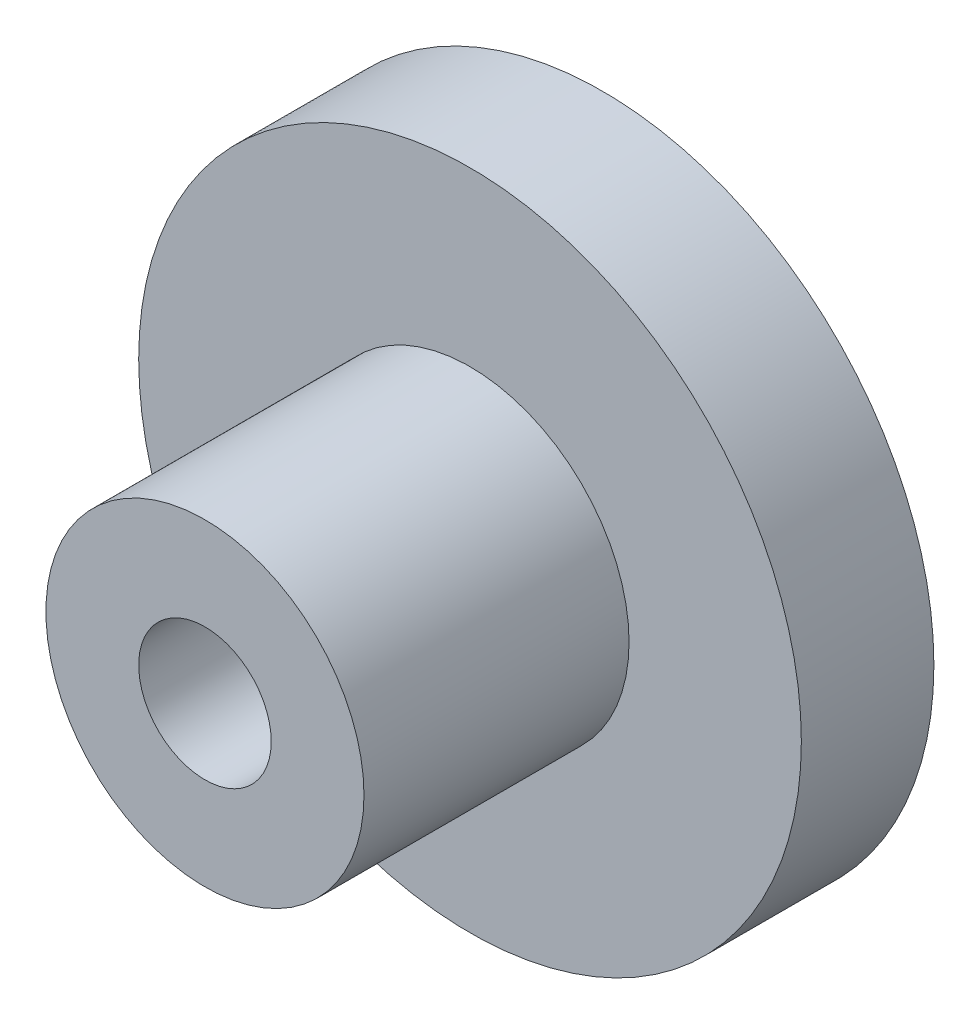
ISO-10303-21;
HEADER;
FILE_DESCRIPTION(('STEP AP214'),'2;1');
FILE_NAME('part.step','',(''),(''),'','','');
FILE_SCHEMA(('AUTOMOTIVE_DESIGN { 1 0 10303 214 1 1 1 1 }'));
ENDSEC;
DATA;
#1=APPLICATION_CONTEXT('core data for automotive mechanical design processes');
#2=APPLICATION_PROTOCOL_DEFINITION('international standard','automotive_design',2000,#1);
#3=PRODUCT_CONTEXT('',#1,'mechanical');
#4=PRODUCT('Part','Part','',(#3));
#5=PRODUCT_RELATED_PRODUCT_CATEGORY('part','',(#4));
#6=PRODUCT_DEFINITION_FORMATION('','',#4);
#7=PRODUCT_DEFINITION_CONTEXT('part definition',#1,'design');
#8=PRODUCT_DEFINITION('design','',#6,#7);
#9=PRODUCT_DEFINITION_SHAPE('','',#8);
#10=(LENGTH_UNIT() NAMED_UNIT(*) SI_UNIT(.MILLI.,.METRE.));
#11=(NAMED_UNIT(*) PLANE_ANGLE_UNIT() SI_UNIT($,.RADIAN.));
#12=(NAMED_UNIT(*) SI_UNIT($,.STERADIAN.) SOLID_ANGLE_UNIT());
#13=UNCERTAINTY_MEASURE_WITH_UNIT(LENGTH_MEASURE(1.E-05),#10,'distance_accuracy_value','');
#14=(GEOMETRIC_REPRESENTATION_CONTEXT(3) GLOBAL_UNCERTAINTY_ASSIGNED_CONTEXT((#13)) GLOBAL_UNIT_ASSIGNED_CONTEXT((#10,
#11,#12)) REPRESENTATION_CONTEXT('',''));
#15=CARTESIAN_POINT('',(0.,0.,0.));
#16=DIRECTION('',(0.,0.,1.));
#17=DIRECTION('',(1.,0.,0.));
#18=AXIS2_PLACEMENT_3D('',#15,#16,#17);
#19=CARTESIAN_POINT('',(0.,0.,15.));
#20=DIRECTION('',(0.,0.,1.));
#21=DIRECTION('',(1.,0.,0.));
#22=AXIS2_PLACEMENT_3D('',#19,#20,#21);
#23=PLANE('',#22);
#24=CARTESIAN_POINT('',(0.,0.,15.));
#25=DIRECTION('',(0.,0.,1.));
#26=DIRECTION('',(1.,0.,0.));
#27=AXIS2_PLACEMENT_3D('',#24,#25,#26);
#28=CIRCLE('',#27,2.5);
#29=CARTESIAN_POINT('',(2.5,0.,15.));
#30=VERTEX_POINT('',#29);
#31=EDGE_CURVE('E49',#30,#30,#28,.T.);
#32=ORIENTED_EDGE('',*,*,#31,.F.);
#33=EDGE_LOOP('',(#32));
#34=FACE_BOUND('',#33,.T.);
#35=CARTESIAN_POINT('',(0.,0.,15.));
#36=DIRECTION('',(0.,0.,1.));
#37=DIRECTION('',(1.,0.,0.));
#38=AXIS2_PLACEMENT_3D('',#35,#36,#37);
#39=CIRCLE('',#38,6.);
#40=CARTESIAN_POINT('',(6.,0.,15.));
#41=VERTEX_POINT('',#40);
#42=EDGE_CURVE('E61',#41,#41,#39,.T.);
#43=ORIENTED_EDGE('',*,*,#42,.T.);
#44=EDGE_LOOP('',(#43));
#45=FACE_BOUND('',#44,.T.);
#46=ADVANCED_FACE('F40',(#34,#45),#23,.T.);
#47=CARTESIAN_POINT('',(0.,0.,15.));
#48=DIRECTION('',(0.,0.,-1.));
#49=DIRECTION('',(-1.,0.,0.));
#50=AXIS2_PLACEMENT_3D('',#47,#48,#49);
#51=CYLINDRICAL_SURFACE('',#50,12.5);
#52=CARTESIAN_POINT('',(0.,0.,0.));
#53=DIRECTION('',(0.,0.,1.));
#54=DIRECTION('',(1.,0.,0.));
#55=AXIS2_PLACEMENT_3D('',#52,#53,#54);
#56=CIRCLE('',#55,12.5);
#57=CARTESIAN_POINT('',(12.5,0.,0.));
#58=VERTEX_POINT('',#57);
#59=EDGE_CURVE('E12',#58,#58,#56,.T.);
#60=ORIENTED_EDGE('',*,*,#59,.T.);
#61=EDGE_LOOP('',(#60));
#62=FACE_BOUND('',#61,.T.);
#63=CARTESIAN_POINT('',(0.,0.,5.));
#64=DIRECTION('',(0.,0.,1.));
#65=DIRECTION('',(1.,0.,0.));
#66=AXIS2_PLACEMENT_3D('',#63,#64,#65);
#67=CIRCLE('',#66,12.5);
#68=CARTESIAN_POINT('',(12.5,0.,5.));
#69=VERTEX_POINT('',#68);
#70=EDGE_CURVE('E44',#69,#69,#67,.T.);
#71=ORIENTED_EDGE('',*,*,#70,.F.);
#72=EDGE_LOOP('',(#71));
#73=FACE_BOUND('',#72,.T.);
#74=ADVANCED_FACE('F42',(#62,#73),#51,.T.);
#75=CARTESIAN_POINT('',(0.,0.,0.));
#76=DIRECTION('',(0.,0.,1.));
#77=DIRECTION('',(1.,0.,0.));
#78=AXIS2_PLACEMENT_3D('',#75,#76,#77);
#79=PLANE('',#78);
#80=ORIENTED_EDGE('',*,*,#59,.F.);
#81=EDGE_LOOP('',(#80));
#82=FACE_BOUND('',#81,.T.);
#83=CARTESIAN_POINT('',(0.,0.,0.));
#84=DIRECTION('',(0.,0.,1.));
#85=DIRECTION('',(1.,0.,0.));
#86=AXIS2_PLACEMENT_3D('',#83,#84,#85);
#87=CIRCLE('',#86,2.5);
#88=CARTESIAN_POINT('',(2.5,0.,0.));
#89=VERTEX_POINT('',#88);
#90=EDGE_CURVE('E56',#89,#89,#87,.T.);
#91=ORIENTED_EDGE('',*,*,#90,.T.);
#92=EDGE_LOOP('',(#91));
#93=FACE_BOUND('',#92,.T.);
#94=ADVANCED_FACE('F76',(#82,#93),#79,.F.);
#95=CARTESIAN_POINT('',(0.,0.,15.));
#96=DIRECTION('',(0.,0.,-1.));
#97=DIRECTION('',(-1.,0.,0.));
#98=AXIS2_PLACEMENT_3D('',#95,#96,#97);
#99=CYLINDRICAL_SURFACE('',#98,2.5);
#100=ORIENTED_EDGE('',*,*,#31,.T.);
#101=EDGE_LOOP('',(#100));
#102=FACE_BOUND('',#101,.T.);
#103=ORIENTED_EDGE('',*,*,#90,.F.);
#104=EDGE_LOOP('',(#103));
#105=FACE_BOUND('',#104,.T.);
#106=ADVANCED_FACE('F82',(#102,#105),#99,.F.);
#107=CARTESIAN_POINT('',(0.,0.,5.));
#108=DIRECTION('',(0.,0.,1.));
#109=DIRECTION('',(1.,0.,0.));
#110=AXIS2_PLACEMENT_3D('',#107,#108,#109);
#111=PLANE('',#110);
#112=CARTESIAN_POINT('',(0.,0.,5.));
#113=DIRECTION('',(0.,0.,1.));
#114=DIRECTION('',(1.,0.,0.));
#115=AXIS2_PLACEMENT_3D('',#112,#113,#114);
#116=CIRCLE('',#115,6.);
#117=CARTESIAN_POINT('',(6.,0.,5.));
#118=VERTEX_POINT('',#117);
#119=EDGE_CURVE('E65',#118,#118,#116,.T.);
#120=ORIENTED_EDGE('',*,*,#119,.F.);
#121=EDGE_LOOP('',(#120));
#122=FACE_BOUND('',#121,.T.);
#123=ORIENTED_EDGE('',*,*,#70,.T.);
#124=EDGE_LOOP('',(#123));
#125=FACE_BOUND('',#124,.T.);
#126=ADVANCED_FACE('F73',(#122,#125),#111,.T.);
#127=CARTESIAN_POINT('',(0.,0.,5.));
#128=DIRECTION('',(0.,0.,1.));
#129=DIRECTION('',(1.,0.,0.));
#130=AXIS2_PLACEMENT_3D('',#127,#128,#129);
#131=CYLINDRICAL_SURFACE('',#130,6.);
#132=ORIENTED_EDGE('',*,*,#119,.T.);
#133=EDGE_LOOP('',(#132));
#134=FACE_BOUND('',#133,.T.);
#135=ORIENTED_EDGE('',*,*,#42,.F.);
#136=EDGE_LOOP('',(#135));
#137=FACE_BOUND('',#136,.T.);
#138=ADVANCED_FACE('F96',(#134,#137),#131,.T.);
#139=CLOSED_SHELL('',(#46,#74,#94,#106,#126,#138));
#140=MANIFOLD_SOLID_BREP('B2',#139);
#141=ADVANCED_BREP_SHAPE_REPRESENTATION('',(#18,#140),#14);
#142=SHAPE_DEFINITION_REPRESENTATION(#9,#141);
ENDSEC;
END-ISO-10303-21;
